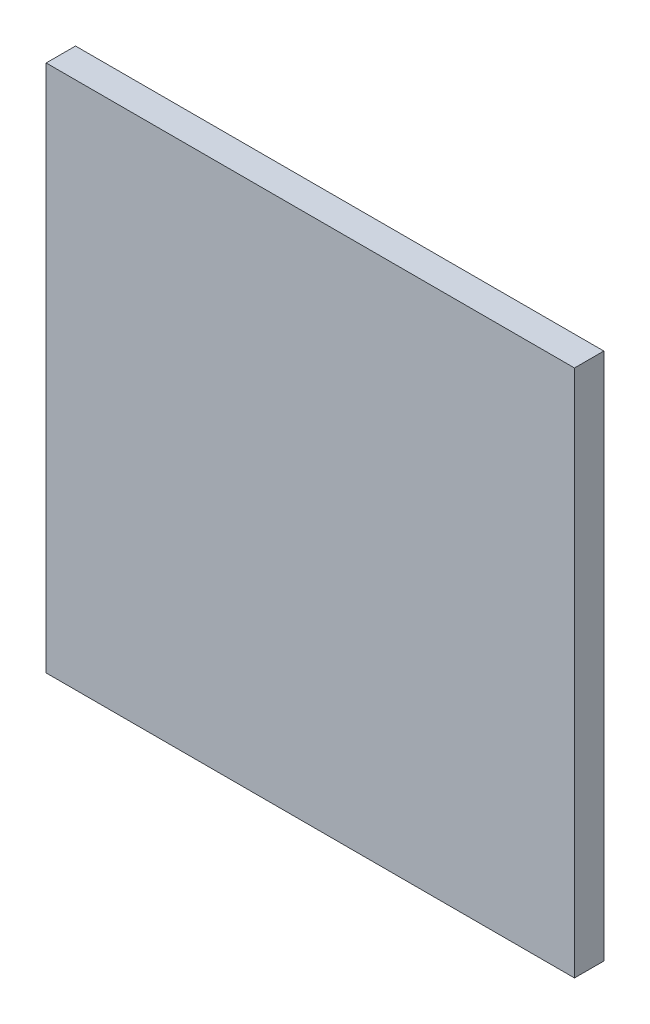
ISO-10303-21;
HEADER;
FILE_DESCRIPTION(('STEP AP214'),'2;1');
FILE_NAME('part.step','',(''),(''),'','','');
FILE_SCHEMA(('AUTOMOTIVE_DESIGN { 1 0 10303 214 1 1 1 1 }'));
ENDSEC;
DATA;
#1=APPLICATION_CONTEXT('core data for automotive mechanical design processes');
#2=APPLICATION_PROTOCOL_DEFINITION('international standard','automotive_design',2000,#1);
#3=PRODUCT_CONTEXT('',#1,'mechanical');
#4=PRODUCT('Part','Part','',(#3));
#5=PRODUCT_RELATED_PRODUCT_CATEGORY('part','',(#4));
#6=PRODUCT_DEFINITION_FORMATION('','',#4);
#7=PRODUCT_DEFINITION_CONTEXT('part definition',#1,'design');
#8=PRODUCT_DEFINITION('design','',#6,#7);
#9=PRODUCT_DEFINITION_SHAPE('','',#8);
#10=(LENGTH_UNIT() NAMED_UNIT(*) SI_UNIT(.MILLI.,.METRE.));
#11=(NAMED_UNIT(*) PLANE_ANGLE_UNIT() SI_UNIT($,.RADIAN.));
#12=(NAMED_UNIT(*) SI_UNIT($,.STERADIAN.) SOLID_ANGLE_UNIT());
#13=UNCERTAINTY_MEASURE_WITH_UNIT(LENGTH_MEASURE(1.E-05),#10,'distance_accuracy_value','');
#14=(GEOMETRIC_REPRESENTATION_CONTEXT(3) GLOBAL_UNCERTAINTY_ASSIGNED_CONTEXT((#13)) GLOBAL_UNIT_ASSIGNED_CONTEXT((#10,
#11,#12)) REPRESENTATION_CONTEXT('',''));
#15=CARTESIAN_POINT('',(0.,0.,0.));
#16=DIRECTION('',(0.,0.,1.));
#17=DIRECTION('',(1.,0.,0.));
#18=AXIS2_PLACEMENT_3D('',#15,#16,#17);
#19=CARTESIAN_POINT('',(57.15,57.15,6.35));
#20=DIRECTION('',(-1.,0.,0.));
#21=DIRECTION('',(0.,-1.,0.));
#22=AXIS2_PLACEMENT_3D('',#19,#20,#21);
#23=PLANE('',#22);
#24=DIRECTION('',(0.,1.,0.));
#25=VECTOR('',#24,1.);
#26=CARTESIAN_POINT('',(57.15,57.15,0.));
#27=LINE('',#26,#25);
#28=CARTESIAN_POINT('',(57.15,-57.15,0.));
#29=VERTEX_POINT('',#28);
#30=CARTESIAN_POINT('',(57.15,57.15,0.));
#31=VERTEX_POINT('',#30);
#32=EDGE_CURVE('E93',#29,#31,#27,.T.);
#33=ORIENTED_EDGE('',*,*,#32,.T.);
#34=DIRECTION('',(0.,0.,-1.));
#35=VECTOR('',#34,1.);
#36=CARTESIAN_POINT('',(57.15,57.15,6.35));
#37=LINE('',#36,#35);
#38=CARTESIAN_POINT('',(57.15,57.15,6.35));
#39=VERTEX_POINT('',#38);
#40=EDGE_CURVE('E11',#39,#31,#37,.T.);
#41=ORIENTED_EDGE('',*,*,#40,.F.);
#42=DIRECTION('',(0.,1.,0.));
#43=VECTOR('',#42,1.);
#44=CARTESIAN_POINT('',(57.15,57.15,6.35));
#45=LINE('',#44,#43);
#46=CARTESIAN_POINT('',(57.15,-57.15,6.35));
#47=VERTEX_POINT('',#46);
#48=EDGE_CURVE('E81',#47,#39,#45,.T.);
#49=ORIENTED_EDGE('',*,*,#48,.F.);
#50=DIRECTION('',(0.,0.,-1.));
#51=VECTOR('',#50,1.);
#52=CARTESIAN_POINT('',(57.15,-57.15,6.35));
#53=LINE('',#52,#51);
#54=EDGE_CURVE('E89',#47,#29,#53,.T.);
#55=ORIENTED_EDGE('',*,*,#54,.T.);
#56=EDGE_LOOP('',(#33,#41,#49,#55));
#57=FACE_BOUND('',#56,.T.);
#58=ADVANCED_FACE('F30',(#57),#23,.F.);
#59=CARTESIAN_POINT('',(-57.15,57.15,6.35));
#60=DIRECTION('',(0.,-1.,0.));
#61=DIRECTION('',(0.,0.,-1.));
#62=AXIS2_PLACEMENT_3D('',#59,#60,#61);
#63=PLANE('',#62);
#64=DIRECTION('',(-1.,0.,0.));
#65=VECTOR('',#64,1.);
#66=CARTESIAN_POINT('',(-57.15,57.15,0.));
#67=LINE('',#66,#65);
#68=CARTESIAN_POINT('',(-57.15,57.15,0.));
#69=VERTEX_POINT('',#68);
#70=EDGE_CURVE('E85',#31,#69,#67,.T.);
#71=ORIENTED_EDGE('',*,*,#70,.T.);
#72=DIRECTION('',(0.,0.,-1.));
#73=VECTOR('',#72,1.);
#74=CARTESIAN_POINT('',(-57.15,57.15,6.35));
#75=LINE('',#74,#73);
#76=CARTESIAN_POINT('',(-57.15,57.15,6.35));
#77=VERTEX_POINT('',#76);
#78=EDGE_CURVE('E38',#77,#69,#75,.T.);
#79=ORIENTED_EDGE('',*,*,#78,.F.);
#80=DIRECTION('',(-1.,0.,0.));
#81=VECTOR('',#80,1.);
#82=CARTESIAN_POINT('',(-57.15,57.15,6.35));
#83=LINE('',#82,#81);
#84=EDGE_CURVE('E76',#39,#77,#83,.T.);
#85=ORIENTED_EDGE('',*,*,#84,.F.);
#86=ORIENTED_EDGE('',*,*,#40,.T.);
#87=EDGE_LOOP('',(#71,#79,#85,#86));
#88=FACE_BOUND('',#87,.T.);
#89=ADVANCED_FACE('F84',(#88),#63,.F.);
#90=CARTESIAN_POINT('',(-57.15,57.15,6.35));
#91=DIRECTION('',(1.,0.,0.));
#92=DIRECTION('',(0.,1.,0.));
#93=AXIS2_PLACEMENT_3D('',#90,#91,#92);
#94=PLANE('',#93);
#95=DIRECTION('',(0.,-1.,0.));
#96=VECTOR('',#95,1.);
#97=CARTESIAN_POINT('',(-57.15,57.15,0.));
#98=LINE('',#97,#96);
#99=CARTESIAN_POINT('',(-57.15,-57.15,0.));
#100=VERTEX_POINT('',#99);
#101=EDGE_CURVE('E63',#69,#100,#98,.T.);
#102=ORIENTED_EDGE('',*,*,#101,.T.);
#103=DIRECTION('',(0.,0.,-1.));
#104=VECTOR('',#103,1.);
#105=CARTESIAN_POINT('',(-57.15,-57.15,6.35));
#106=LINE('',#105,#104);
#107=CARTESIAN_POINT('',(-57.15,-57.15,6.35));
#108=VERTEX_POINT('',#107);
#109=EDGE_CURVE('E86',#108,#100,#106,.T.);
#110=ORIENTED_EDGE('',*,*,#109,.F.);
#111=DIRECTION('',(0.,-1.,0.));
#112=VECTOR('',#111,1.);
#113=CARTESIAN_POINT('',(-57.15,57.15,6.35));
#114=LINE('',#113,#112);
#115=EDGE_CURVE('E79',#77,#108,#114,.T.);
#116=ORIENTED_EDGE('',*,*,#115,.F.);
#117=ORIENTED_EDGE('',*,*,#78,.T.);
#118=EDGE_LOOP('',(#102,#110,#116,#117));
#119=FACE_BOUND('',#118,.T.);
#120=ADVANCED_FACE('F87',(#119),#94,.F.);
#121=CARTESIAN_POINT('',(-57.15,-57.15,6.35));
#122=DIRECTION('',(0.,1.,0.));
#123=DIRECTION('',(0.,0.,1.));
#124=AXIS2_PLACEMENT_3D('',#121,#122,#123);
#125=PLANE('',#124);
#126=DIRECTION('',(1.,0.,0.));
#127=VECTOR('',#126,1.);
#128=CARTESIAN_POINT('',(-57.15,-57.15,0.));
#129=LINE('',#128,#127);
#130=EDGE_CURVE('E69',#100,#29,#129,.T.);
#131=ORIENTED_EDGE('',*,*,#130,.T.);
#132=ORIENTED_EDGE('',*,*,#54,.F.);
#133=DIRECTION('',(1.,0.,0.));
#134=VECTOR('',#133,1.);
#135=CARTESIAN_POINT('',(-57.15,-57.15,6.35));
#136=LINE('',#135,#134);
#137=EDGE_CURVE('E46',#108,#47,#136,.T.);
#138=ORIENTED_EDGE('',*,*,#137,.F.);
#139=ORIENTED_EDGE('',*,*,#109,.T.);
#140=EDGE_LOOP('',(#131,#132,#138,#139));
#141=FACE_BOUND('',#140,.T.);
#142=ADVANCED_FACE('F100',(#141),#125,.F.);
#143=CARTESIAN_POINT('',(57.15,-57.15,6.35));
#144=DIRECTION('',(0.,0.,1.));
#145=DIRECTION('',(1.,0.,0.));
#146=AXIS2_PLACEMENT_3D('',#143,#144,#145);
#147=PLANE('',#146);
#148=ORIENTED_EDGE('',*,*,#48,.T.);
#149=ORIENTED_EDGE('',*,*,#84,.T.);
#150=ORIENTED_EDGE('',*,*,#115,.T.);
#151=ORIENTED_EDGE('',*,*,#137,.T.);
#152=EDGE_LOOP('',(#148,#149,#150,#151));
#153=FACE_BOUND('',#152,.T.);
#154=ADVANCED_FACE('F77',(#153),#147,.T.);
#155=CARTESIAN_POINT('',(57.15,-57.15,0.));
#156=DIRECTION('',(0.,0.,1.));
#157=DIRECTION('',(1.,0.,0.));
#158=AXIS2_PLACEMENT_3D('',#155,#156,#157);
#159=PLANE('',#158);
#160=ORIENTED_EDGE('',*,*,#32,.F.);
#161=ORIENTED_EDGE('',*,*,#130,.F.);
#162=ORIENTED_EDGE('',*,*,#101,.F.);
#163=ORIENTED_EDGE('',*,*,#70,.F.);
#164=EDGE_LOOP('',(#160,#161,#162,#163));
#165=FACE_BOUND('',#164,.T.);
#166=ADVANCED_FACE('F103',(#165),#159,.F.);
#167=CLOSED_SHELL('',(#58,#89,#120,#142,#154,#166));
#168=MANIFOLD_SOLID_BREP('B2',#167);
#169=ADVANCED_BREP_SHAPE_REPRESENTATION('',(#18,#168),#14);
#170=SHAPE_DEFINITION_REPRESENTATION(#9,#169);
ENDSEC;
END-ISO-10303-21;
